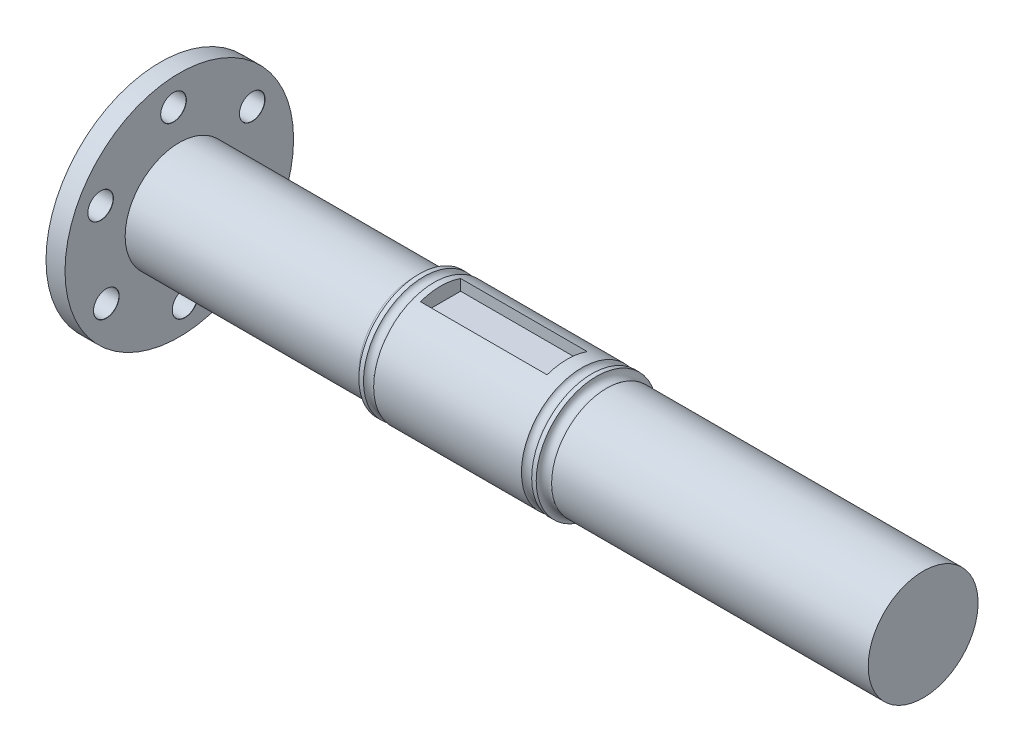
ISO-10303-21;
HEADER;
FILE_DESCRIPTION(('STEP AP214'),'2;1');
FILE_NAME('part.step','',(''),(''),'','','');
FILE_SCHEMA(('AUTOMOTIVE_DESIGN { 1 0 10303 214 1 1 1 1 }'));
ENDSEC;
DATA;
#1=APPLICATION_CONTEXT('core data for automotive mechanical design processes');
#2=APPLICATION_PROTOCOL_DEFINITION('international standard','automotive_design',2000,#1);
#3=PRODUCT_CONTEXT('',#1,'mechanical');
#4=PRODUCT('Part','Part','',(#3));
#5=PRODUCT_RELATED_PRODUCT_CATEGORY('part','',(#4));
#6=PRODUCT_DEFINITION_FORMATION('','',#4);
#7=PRODUCT_DEFINITION_CONTEXT('part definition',#1,'design');
#8=PRODUCT_DEFINITION('design','',#6,#7);
#9=PRODUCT_DEFINITION_SHAPE('','',#8);
#10=(LENGTH_UNIT() NAMED_UNIT(*) SI_UNIT(.MILLI.,.METRE.));
#11=(NAMED_UNIT(*) PLANE_ANGLE_UNIT() SI_UNIT($,.RADIAN.));
#12=(NAMED_UNIT(*) SI_UNIT($,.STERADIAN.) SOLID_ANGLE_UNIT());
#13=UNCERTAINTY_MEASURE_WITH_UNIT(LENGTH_MEASURE(1.E-05),#10,'distance_accuracy_value','');
#14=(GEOMETRIC_REPRESENTATION_CONTEXT(3) GLOBAL_UNCERTAINTY_ASSIGNED_CONTEXT((#13)) GLOBAL_UNIT_ASSIGNED_CONTEXT((#10,
#11,#12)) REPRESENTATION_CONTEXT('',''));
#15=CARTESIAN_POINT('',(0.,0.,0.));
#16=DIRECTION('',(0.,0.,1.));
#17=DIRECTION('',(1.,0.,0.));
#18=AXIS2_PLACEMENT_3D('',#15,#16,#17);
#19=CARTESIAN_POINT('',(15.223236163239,9.4610077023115,0.));
#20=DIRECTION('',(-1.,0.,0.));
#21=DIRECTION('',(0.,0.,1.));
#22=AXIS2_PLACEMENT_3D('',#19,#20,#21);
#23=CYLINDRICAL_SURFACE('',#22,9.54020579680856);
#24=CARTESIAN_POINT('',(86.2912501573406,9.4610077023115,0.));
#25=DIRECTION('',(-1.,0.,0.));
#26=DIRECTION('',(0.,0.,1.));
#27=AXIS2_PLACEMENT_3D('',#24,#25,#26);
#28=CIRCLE('',#27,9.54020579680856);
#29=CARTESIAN_POINT('',(86.2912501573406,9.4610077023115,9.54020579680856));
#30=VERTEX_POINT('',#29);
#31=EDGE_CURVE('E207',#30,#30,#28,.T.);
#32=ORIENTED_EDGE('',*,*,#31,.T.);
#33=EDGE_LOOP('',(#32));
#34=FACE_BOUND('',#33,.T.);
#35=CARTESIAN_POINT('',(62.9546037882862,9.4610077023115,0.));
#36=DIRECTION('',(-1.,0.,0.));
#37=DIRECTION('',(0.,0.,1.));
#38=AXIS2_PLACEMENT_3D('',#35,#36,#37);
#39=CIRCLE('',#38,9.54020579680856);
#40=CARTESIAN_POINT('',(62.9546037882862,9.4610077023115,9.54020579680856));
#41=VERTEX_POINT('',#40);
#42=EDGE_CURVE('E211',#41,#41,#39,.T.);
#43=ORIENTED_EDGE('',*,*,#42,.F.);
#44=EDGE_LOOP('',(#43));
#45=FACE_BOUND('',#44,.T.);
#46=DIRECTION('',(-1.,0.,0.));
#47=VECTOR('',#46,1.);
#48=CARTESIAN_POINT('',(15.223236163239,18.4573904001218,-3.175));
#49=LINE('',#48,#47);
#50=CARTESIAN_POINT('',(63.973236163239,18.4573904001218,-3.175));
#51=VERTEX_POINT('',#50);
#52=CARTESIAN_POINT('',(83.973236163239,18.4573904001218,-3.175));
#53=VERTEX_POINT('',#52);
#54=EDGE_CURVE('E267',#51,#53,#49,.F.);
#55=ORIENTED_EDGE('',*,*,#54,.T.);
#56=CARTESIAN_POINT('',(83.973236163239,9.4610077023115,0.));
#57=DIRECTION('',(-1.,0.,0.));
#58=DIRECTION('',(0.,0.,1.));
#59=AXIS2_PLACEMENT_3D('',#56,#57,#58);
#60=CIRCLE('',#59,9.54020579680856);
#61=CARTESIAN_POINT('',(83.973236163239,18.4573904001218,3.175));
#62=VERTEX_POINT('',#61);
#63=EDGE_CURVE('E11',#53,#62,#60,.F.);
#64=ORIENTED_EDGE('',*,*,#63,.T.);
#65=DIRECTION('',(-1.,0.,0.));
#66=VECTOR('',#65,1.);
#67=CARTESIAN_POINT('',(15.223236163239,18.4573904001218,3.175));
#68=LINE('',#67,#66);
#69=CARTESIAN_POINT('',(63.973236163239,18.4573904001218,3.175));
#70=VERTEX_POINT('',#69);
#71=EDGE_CURVE('E56',#62,#70,#68,.T.);
#72=ORIENTED_EDGE('',*,*,#71,.T.);
#73=CARTESIAN_POINT('',(63.973236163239,9.4610077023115,0.));
#74=DIRECTION('',(-1.,0.,0.));
#75=DIRECTION('',(0.,0.,1.));
#76=AXIS2_PLACEMENT_3D('',#73,#74,#75);
#77=CIRCLE('',#76,9.54020579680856);
#78=EDGE_CURVE('E94',#51,#70,#77,.F.);
#79=ORIENTED_EDGE('',*,*,#78,.F.);
#80=EDGE_LOOP('',(#55,#64,#72,#79));
#81=FACE_BOUND('',#80,.T.);
#82=ADVANCED_FACE('F47',(#34,#45,#81),#23,.T.);
#83=CARTESIAN_POINT('',(15.223236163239,0.,0.));
#84=DIRECTION('',(1.,0.,0.));
#85=DIRECTION('',(0.,0.,-1.));
#86=AXIS2_PLACEMENT_3D('',#83,#84,#85);
#87=PLANE('',#86);
#88=CARTESIAN_POINT('',(15.223236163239,9.4610077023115,0.));
#89=DIRECTION('',(1.,0.,0.));
#90=DIRECTION('',(0.,0.,-1.));
#91=AXIS2_PLACEMENT_3D('',#88,#89,#90);
#92=CIRCLE('',#91,2.);
#93=CARTESIAN_POINT('',(15.223236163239,9.4610077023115,-2.));
#94=VERTEX_POINT('',#93);
#95=EDGE_CURVE('E187',#94,#94,#92,.T.);
#96=ORIENTED_EDGE('',*,*,#95,.T.);
#97=EDGE_LOOP('',(#96));
#98=FACE_BOUND('',#97,.T.);
#99=CARTESIAN_POINT('',(15.223236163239,9.4610077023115,0.));
#100=DIRECTION('',(-1.,0.,0.));
#101=DIRECTION('',(0.,0.,1.));
#102=AXIS2_PLACEMENT_3D('',#99,#100,#101);
#103=CIRCLE('',#102,10.5);
#104=CARTESIAN_POINT('',(15.223236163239,9.4610077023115,10.5));
#105=VERTEX_POINT('',#104);
#106=EDGE_CURVE('E243',#105,#105,#103,.T.);
#107=ORIENTED_EDGE('',*,*,#106,.T.);
#108=EDGE_LOOP('',(#107));
#109=FACE_BOUND('',#108,.T.);
#110=ADVANCED_FACE('F49',(#98,#109),#87,.F.);
#111=CARTESIAN_POINT('',(15.223236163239,9.4610077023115,0.));
#112=DIRECTION('',(-1.,0.,0.));
#113=DIRECTION('',(0.,0.,1.));
#114=AXIS2_PLACEMENT_3D('',#111,#112,#113);
#115=CYLINDRICAL_SURFACE('',#114,10.5);
#116=CARTESIAN_POINT('',(19.723236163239,9.4610077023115,0.));
#117=DIRECTION('',(-1.,0.,0.));
#118=DIRECTION('',(0.,0.,1.));
#119=AXIS2_PLACEMENT_3D('',#116,#117,#118);
#120=CIRCLE('',#119,10.5);
#121=CARTESIAN_POINT('',(19.723236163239,9.4610077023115,10.5));
#122=VERTEX_POINT('',#121);
#123=EDGE_CURVE('E239',#122,#122,#120,.T.);
#124=ORIENTED_EDGE('',*,*,#123,.T.);
#125=EDGE_LOOP('',(#124));
#126=FACE_BOUND('',#125,.T.);
#127=ORIENTED_EDGE('',*,*,#106,.F.);
#128=EDGE_LOOP('',(#127));
#129=FACE_BOUND('',#128,.T.);
#130=ADVANCED_FACE('F291',(#126,#129),#115,.T.);
#131=CARTESIAN_POINT('',(19.723236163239,0.,0.));
#132=DIRECTION('',(-1.,0.,0.));
#133=DIRECTION('',(0.,0.,1.));
#134=AXIS2_PLACEMENT_3D('',#131,#132,#133);
#135=PLANE('',#134);
#136=CARTESIAN_POINT('',(19.723236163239,17.1610077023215,-11.518137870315));
#137=DIRECTION('',(-1.,0.,0.));
#138=DIRECTION('',(0.,0.,1.));
#139=AXIS2_PLACEMENT_3D('',#136,#137,#138);
#140=CIRCLE('',#139,2.);
#141=CARTESIAN_POINT('',(19.723236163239,17.1610077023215,-9.51813787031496));
#142=VERTEX_POINT('',#141);
#143=EDGE_CURVE('E133',#142,#142,#140,.T.);
#144=ORIENTED_EDGE('',*,*,#143,.F.);
#145=EDGE_LOOP('',(#144));
#146=FACE_BOUND('',#145,.T.);
#147=CARTESIAN_POINT('',(19.723236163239,3.33600770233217,-12.4274645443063));
#148=DIRECTION('',(-1.,0.,0.));
#149=DIRECTION('',(0.,0.,1.));
#150=AXIS2_PLACEMENT_3D('',#147,#148,#149);
#151=CIRCLE('',#150,2.);
#152=CARTESIAN_POINT('',(19.723236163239,3.33600770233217,-10.4274645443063));
#153=VERTEX_POINT('',#152);
#154=EDGE_CURVE('E142',#153,#153,#151,.T.);
#155=ORIENTED_EDGE('',*,*,#154,.F.);
#156=EDGE_LOOP('',(#155));
#157=FACE_BOUND('',#156,.T.);
#158=CARTESIAN_POINT('',(19.723236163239,23.2860077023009,0.90932667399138));
#159=DIRECTION('',(-1.,0.,0.));
#160=DIRECTION('',(0.,0.,1.));
#161=AXIS2_PLACEMENT_3D('',#158,#159,#160);
#162=CIRCLE('',#161,2.);
#163=CARTESIAN_POINT('',(19.723236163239,23.2860077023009,2.90932667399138));
#164=VERTEX_POINT('',#163);
#165=EDGE_CURVE('E151',#164,#164,#162,.T.);
#166=ORIENTED_EDGE('',*,*,#165,.F.);
#167=EDGE_LOOP('',(#166));
#168=FACE_BOUND('',#167,.T.);
#169=CARTESIAN_POINT('',(19.723236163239,-4.36399229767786,-0.909326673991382));
#170=DIRECTION('',(-1.,0.,0.));
#171=DIRECTION('',(0.,0.,1.));
#172=AXIS2_PLACEMENT_3D('',#169,#170,#171);
#173=CIRCLE('',#172,2.);
#174=CARTESIAN_POINT('',(19.723236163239,-4.36399229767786,1.09067332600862));
#175=VERTEX_POINT('',#174);
#176=EDGE_CURVE('E160',#175,#175,#173,.T.);
#177=ORIENTED_EDGE('',*,*,#176,.F.);
#178=EDGE_LOOP('',(#177));
#179=FACE_BOUND('',#178,.T.);
#180=CARTESIAN_POINT('',(19.723236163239,1.76100770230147,11.518137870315));
#181=DIRECTION('',(-1.,0.,0.));
#182=DIRECTION('',(0.,0.,1.));
#183=AXIS2_PLACEMENT_3D('',#180,#181,#182);
#184=CIRCLE('',#183,2.);
#185=CARTESIAN_POINT('',(19.723236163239,1.76100770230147,13.518137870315));
#186=VERTEX_POINT('',#185);
#187=EDGE_CURVE('E169',#186,#186,#184,.T.);
#188=ORIENTED_EDGE('',*,*,#187,.F.);
#189=EDGE_LOOP('',(#188));
#190=FACE_BOUND('',#189,.T.);
#191=CARTESIAN_POINT('',(19.723236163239,15.5860077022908,12.4274645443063));
#192=DIRECTION('',(-1.,0.,0.));
#193=DIRECTION('',(0.,0.,1.));
#194=AXIS2_PLACEMENT_3D('',#191,#192,#193);
#195=CIRCLE('',#194,2.);
#196=CARTESIAN_POINT('',(19.723236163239,15.5860077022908,14.4274645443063));
#197=VERTEX_POINT('',#196);
#198=EDGE_CURVE('E178',#197,#197,#195,.T.);
#199=ORIENTED_EDGE('',*,*,#198,.F.);
#200=EDGE_LOOP('',(#199));
#201=FACE_BOUND('',#200,.T.);
#202=CARTESIAN_POINT('',(19.723236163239,9.4610077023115,0.));
#203=DIRECTION('',(-1.,0.,0.));
#204=DIRECTION('',(0.,0.,1.));
#205=AXIS2_PLACEMENT_3D('',#202,#203,#204);
#206=CIRCLE('',#205,18.05);
#207=CARTESIAN_POINT('',(19.723236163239,9.4610077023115,18.05));
#208=VERTEX_POINT('',#207);
#209=EDGE_CURVE('E235',#208,#208,#206,.T.);
#210=ORIENTED_EDGE('',*,*,#209,.T.);
#211=EDGE_LOOP('',(#210));
#212=FACE_BOUND('',#211,.T.);
#213=ORIENTED_EDGE('',*,*,#123,.F.);
#214=EDGE_LOOP('',(#213));
#215=FACE_BOUND('',#214,.T.);
#216=ADVANCED_FACE('F321',(#146,#157,#168,#179,#190,#201,#212,#215),#135,.T.);
#217=CARTESIAN_POINT('',(15.223236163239,9.4610077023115,0.));
#218=DIRECTION('',(-1.,0.,0.));
#219=DIRECTION('',(0.,0.,1.));
#220=AXIS2_PLACEMENT_3D('',#217,#218,#219);
#221=CYLINDRICAL_SURFACE('',#220,18.05);
#222=CARTESIAN_POINT('',(22.723236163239,9.4610077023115,0.));
#223=DIRECTION('',(-1.,0.,0.));
#224=DIRECTION('',(0.,0.,1.));
#225=AXIS2_PLACEMENT_3D('',#222,#223,#224);
#226=CIRCLE('',#225,18.05);
#227=CARTESIAN_POINT('',(22.723236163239,9.4610077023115,18.05));
#228=VERTEX_POINT('',#227);
#229=EDGE_CURVE('E231',#228,#228,#226,.T.);
#230=ORIENTED_EDGE('',*,*,#229,.T.);
#231=EDGE_LOOP('',(#230));
#232=FACE_BOUND('',#231,.T.);
#233=ORIENTED_EDGE('',*,*,#209,.F.);
#234=EDGE_LOOP('',(#233));
#235=FACE_BOUND('',#234,.T.);
#236=ADVANCED_FACE('F317',(#232,#235),#221,.T.);
#237=CARTESIAN_POINT('',(22.723236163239,0.,0.));
#238=DIRECTION('',(1.,0.,0.));
#239=DIRECTION('',(0.,0.,-1.));
#240=AXIS2_PLACEMENT_3D('',#237,#238,#239);
#241=PLANE('',#240);
#242=CARTESIAN_POINT('',(22.723236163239,17.1610077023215,-11.518137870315));
#243=DIRECTION('',(1.,0.,0.));
#244=DIRECTION('',(0.,0.,-1.));
#245=AXIS2_PLACEMENT_3D('',#242,#243,#244);
#246=CIRCLE('',#245,2.025);
#247=CARTESIAN_POINT('',(22.723236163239,17.1610077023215,-13.543137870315));
#248=VERTEX_POINT('',#247);
#249=EDGE_CURVE('E106',#248,#248,#246,.T.);
#250=ORIENTED_EDGE('',*,*,#249,.F.);
#251=EDGE_LOOP('',(#250));
#252=FACE_BOUND('',#251,.T.);
#253=CARTESIAN_POINT('',(22.723236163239,3.33600770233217,-12.4274645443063));
#254=DIRECTION('',(1.,0.,0.));
#255=DIRECTION('',(0.,0.,-1.));
#256=AXIS2_PLACEMENT_3D('',#253,#254,#255);
#257=CIRCLE('',#256,2.025);
#258=CARTESIAN_POINT('',(22.723236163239,3.33600770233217,-14.4524645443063));
#259=VERTEX_POINT('',#258);
#260=EDGE_CURVE('E134',#259,#259,#257,.T.);
#261=ORIENTED_EDGE('',*,*,#260,.F.);
#262=EDGE_LOOP('',(#261));
#263=FACE_BOUND('',#262,.T.);
#264=CARTESIAN_POINT('',(22.723236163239,23.2860077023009,0.90932667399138));
#265=DIRECTION('',(1.,0.,0.));
#266=DIRECTION('',(0.,0.,-1.));
#267=AXIS2_PLACEMENT_3D('',#264,#265,#266);
#268=CIRCLE('',#267,2.025);
#269=CARTESIAN_POINT('',(22.723236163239,23.2860077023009,-1.11567332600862));
#270=VERTEX_POINT('',#269);
#271=EDGE_CURVE('E143',#270,#270,#268,.T.);
#272=ORIENTED_EDGE('',*,*,#271,.F.);
#273=EDGE_LOOP('',(#272));
#274=FACE_BOUND('',#273,.T.);
#275=CARTESIAN_POINT('',(22.723236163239,-4.36399229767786,-0.909326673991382));
#276=DIRECTION('',(1.,0.,0.));
#277=DIRECTION('',(0.,0.,-1.));
#278=AXIS2_PLACEMENT_3D('',#275,#276,#277);
#279=CIRCLE('',#278,2.025);
#280=CARTESIAN_POINT('',(22.723236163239,-4.36399229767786,-2.93432667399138));
#281=VERTEX_POINT('',#280);
#282=EDGE_CURVE('E152',#281,#281,#279,.T.);
#283=ORIENTED_EDGE('',*,*,#282,.F.);
#284=EDGE_LOOP('',(#283));
#285=FACE_BOUND('',#284,.T.);
#286=CARTESIAN_POINT('',(22.723236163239,1.76100770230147,11.518137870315));
#287=DIRECTION('',(1.,0.,0.));
#288=DIRECTION('',(0.,0.,-1.));
#289=AXIS2_PLACEMENT_3D('',#286,#287,#288);
#290=CIRCLE('',#289,2.025);
#291=CARTESIAN_POINT('',(22.723236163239,1.76100770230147,9.49313787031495));
#292=VERTEX_POINT('',#291);
#293=EDGE_CURVE('E161',#292,#292,#290,.T.);
#294=ORIENTED_EDGE('',*,*,#293,.F.);
#295=EDGE_LOOP('',(#294));
#296=FACE_BOUND('',#295,.T.);
#297=CARTESIAN_POINT('',(22.723236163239,15.5860077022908,12.4274645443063));
#298=DIRECTION('',(1.,0.,0.));
#299=DIRECTION('',(0.,0.,-1.));
#300=AXIS2_PLACEMENT_3D('',#297,#298,#299);
#301=CIRCLE('',#300,2.025);
#302=CARTESIAN_POINT('',(22.723236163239,15.5860077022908,10.4024645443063));
#303=VERTEX_POINT('',#302);
#304=EDGE_CURVE('E170',#303,#303,#301,.T.);
#305=ORIENTED_EDGE('',*,*,#304,.F.);
#306=EDGE_LOOP('',(#305));
#307=FACE_BOUND('',#306,.T.);
#308=CARTESIAN_POINT('',(22.723236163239,9.4610077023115,0.));
#309=DIRECTION('',(-1.,0.,0.));
#310=DIRECTION('',(0.,0.,1.));
#311=AXIS2_PLACEMENT_3D('',#308,#309,#310);
#312=CIRCLE('',#311,8.55);
#313=CARTESIAN_POINT('',(22.723236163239,9.4610077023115,8.55));
#314=VERTEX_POINT('',#313);
#315=EDGE_CURVE('E227',#314,#314,#312,.T.);
#316=ORIENTED_EDGE('',*,*,#315,.T.);
#317=EDGE_LOOP('',(#316));
#318=FACE_BOUND('',#317,.T.);
#319=ORIENTED_EDGE('',*,*,#229,.F.);
#320=EDGE_LOOP('',(#319));
#321=FACE_BOUND('',#320,.T.);
#322=ADVANCED_FACE('F313',(#252,#263,#274,#285,#296,#307,#318,#321),#241,.T.);
#323=CARTESIAN_POINT('',(15.223236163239,9.4610077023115,0.));
#324=DIRECTION('',(-1.,0.,0.));
#325=DIRECTION('',(0.,0.,1.));
#326=AXIS2_PLACEMENT_3D('',#323,#324,#325);
#327=CYLINDRICAL_SURFACE('',#326,8.55);
#328=CARTESIAN_POINT('',(59.653236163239,9.4610077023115,0.));
#329=DIRECTION('',(-1.,0.,0.));
#330=DIRECTION('',(0.,0.,1.));
#331=AXIS2_PLACEMENT_3D('',#328,#329,#330);
#332=CIRCLE('',#331,8.55);
#333=CARTESIAN_POINT('',(59.653236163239,9.4610077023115,8.55));
#334=VERTEX_POINT('',#333);
#335=EDGE_CURVE('E223',#334,#334,#332,.T.);
#336=ORIENTED_EDGE('',*,*,#335,.T.);
#337=EDGE_LOOP('',(#336));
#338=FACE_BOUND('',#337,.T.);
#339=ORIENTED_EDGE('',*,*,#315,.F.);
#340=EDGE_LOOP('',(#339));
#341=FACE_BOUND('',#340,.T.);
#342=ADVANCED_FACE('F309',(#338,#341),#327,.T.);
#343=CARTESIAN_POINT('',(59.6212935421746,9.4610077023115,0.));
#344=DIRECTION('',(-1.,0.,0.));
#345=DIRECTION('',(0.,0.,1.));
#346=AXIS2_PLACEMENT_3D('',#343,#344,#345);
#347=TOROIDAL_SURFACE('',#346,9.5494897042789,0.999999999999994);
#348=ORIENTED_EDGE('',*,*,#335,.F.);
#349=EDGE_LOOP('',(#348));
#350=FACE_BOUND('',#349,.T.);
#351=CARTESIAN_POINT('',(60.621250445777,9.4610077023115,0.));
#352=DIRECTION('',(-1.,0.,0.));
#353=DIRECTION('',(0.,0.,1.));
#354=AXIS2_PLACEMENT_3D('',#351,#352,#353);
#355=CIRCLE('',#354,9.54020579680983);
#356=CARTESIAN_POINT('',(60.621250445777,9.4610077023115,9.54020579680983));
#357=VERTEX_POINT('',#356);
#358=EDGE_CURVE('E219',#357,#357,#355,.T.);
#359=ORIENTED_EDGE('',*,*,#358,.T.);
#360=EDGE_LOOP('',(#359));
#361=FACE_BOUND('',#360,.T.);
#362=ADVANCED_FACE('F305',(#350,#361),#347,.F.);
#363=CARTESIAN_POINT('',(15.223236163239,9.4610077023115,0.));
#364=DIRECTION('',(-1.,0.,0.));
#365=DIRECTION('',(0.,0.,1.));
#366=AXIS2_PLACEMENT_3D('',#363,#364,#365);
#367=CYLINDRICAL_SURFACE('',#366,9.54020579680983);
#368=CARTESIAN_POINT('',(61.3447504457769,9.4610077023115,0.));
#369=DIRECTION('',(-1.,0.,0.));
#370=DIRECTION('',(0.,0.,1.));
#371=AXIS2_PLACEMENT_3D('',#368,#369,#370);
#372=CIRCLE('',#371,9.54020579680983);
#373=CARTESIAN_POINT('',(61.3447504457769,9.4610077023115,9.54020579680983));
#374=VERTEX_POINT('',#373);
#375=EDGE_CURVE('E215',#374,#374,#372,.T.);
#376=ORIENTED_EDGE('',*,*,#375,.T.);
#377=EDGE_LOOP('',(#376));
#378=FACE_BOUND('',#377,.T.);
#379=ORIENTED_EDGE('',*,*,#358,.F.);
#380=EDGE_LOOP('',(#379));
#381=FACE_BOUND('',#380,.T.);
#382=ADVANCED_FACE('F301',(#378,#381),#367,.T.);
#383=CARTESIAN_POINT('',(62.1496771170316,9.4610077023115,0.));
#384=DIRECTION('',(-1.,0.,0.));
#385=DIRECTION('',(0.,0.,1.));
#386=AXIS2_PLACEMENT_3D('',#383,#384,#385);
#387=TOROIDAL_SURFACE('',#386,9.92726729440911,0.893153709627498);
#388=ORIENTED_EDGE('',*,*,#42,.T.);
#389=EDGE_LOOP('',(#388));
#390=FACE_BOUND('',#389,.T.);
#391=ORIENTED_EDGE('',*,*,#375,.F.);
#392=EDGE_LOOP('',(#391));
#393=FACE_BOUND('',#392,.T.);
#394=ADVANCED_FACE('F298',(#390,#393),#387,.F.);
#395=CARTESIAN_POINT('',(87.0974731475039,9.4610077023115,0.));
#396=DIRECTION('',(-1.,0.,0.));
#397=DIRECTION('',(0.,0.,1.));
#398=AXIS2_PLACEMENT_3D('',#395,#396,#397);
#399=TOROIDAL_SURFACE('',#398,9.92320319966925,0.892570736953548);
#400=CARTESIAN_POINT('',(87.9012501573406,9.4610077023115,0.));
#401=DIRECTION('',(-1.,0.,0.));
#402=DIRECTION('',(0.,0.,1.));
#403=AXIS2_PLACEMENT_3D('',#400,#401,#402);
#404=CIRCLE('',#403,9.53509878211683);
#405=CARTESIAN_POINT('',(87.9012501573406,9.4610077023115,9.53509878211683));
#406=VERTEX_POINT('',#405);
#407=EDGE_CURVE('E203',#406,#406,#404,.T.);
#408=ORIENTED_EDGE('',*,*,#407,.T.);
#409=EDGE_LOOP('',(#408));
#410=FACE_BOUND('',#409,.T.);
#411=ORIENTED_EDGE('',*,*,#31,.F.);
#412=EDGE_LOOP('',(#411));
#413=FACE_BOUND('',#412,.T.);
#414=ADVANCED_FACE('F296',(#410,#413),#399,.F.);
#415=CARTESIAN_POINT('',(87.9012501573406,9.4610077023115,0.));
#416=DIRECTION('',(1.,0.,0.));
#417=DIRECTION('',(0.,0.,-1.));
#418=AXIS2_PLACEMENT_3D('',#415,#416,#417);
#419=CONICAL_SURFACE('',#418,9.53509878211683,0.00151111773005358);
#420=CARTESIAN_POINT('',(88.6212501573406,9.4610077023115,0.));
#421=DIRECTION('',(-1.,0.,0.));
#422=DIRECTION('',(0.,0.,1.));
#423=AXIS2_PLACEMENT_3D('',#420,#421,#422);
#424=CIRCLE('',#423,9.53618678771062);
#425=CARTESIAN_POINT('',(88.6212501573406,9.4610077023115,9.53618678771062));
#426=VERTEX_POINT('',#425);
#427=EDGE_CURVE('E199',#426,#426,#424,.T.);
#428=ORIENTED_EDGE('',*,*,#427,.T.);
#429=EDGE_LOOP('',(#428));
#430=FACE_BOUND('',#429,.T.);
#431=ORIENTED_EDGE('',*,*,#407,.F.);
#432=EDGE_LOOP('',(#431));
#433=FACE_BOUND('',#432,.T.);
#434=ADVANCED_FACE('F369',(#430,#433),#419,.T.);
#435=CARTESIAN_POINT('',(89.6204667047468,9.4610077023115,0.));
#436=DIRECTION('',(-1.,0.,0.));
#437=DIRECTION('',(0.,0.,1.));
#438=AXIS2_PLACEMENT_3D('',#435,#436,#437);
#439=TOROIDAL_SURFACE('',#438,9.4966103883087,0.999999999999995);
#440=CARTESIAN_POINT('',(90.1914298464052,9.4610077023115,0.));
#441=DIRECTION('',(-1.,0.,0.));
#442=DIRECTION('',(0.,0.,1.));
#443=AXIS2_PLACEMENT_3D('',#440,#441,#442);
#444=CIRCLE('',#443,8.67563469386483);
#445=CARTESIAN_POINT('',(90.1914298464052,9.4610077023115,8.67563469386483));
#446=VERTEX_POINT('',#445);
#447=EDGE_CURVE('E195',#446,#446,#444,.T.);
#448=ORIENTED_EDGE('',*,*,#447,.T.);
#449=EDGE_LOOP('',(#448));
#450=FACE_BOUND('',#449,.T.);
#451=ORIENTED_EDGE('',*,*,#427,.F.);
#452=EDGE_LOOP('',(#451));
#453=FACE_BOUND('',#452,.T.);
#454=ADVANCED_FACE('F377',(#450,#453),#439,.F.);
#455=CARTESIAN_POINT('',(15.223236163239,9.4610077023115,0.));
#456=DIRECTION('',(-1.,0.,0.));
#457=DIRECTION('',(0.,0.,1.));
#458=AXIS2_PLACEMENT_3D('',#455,#456,#457);
#459=CYLINDRICAL_SURFACE('',#458,8.67563469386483);
#460=CARTESIAN_POINT('',(140.191429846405,9.4610077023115,0.));
#461=DIRECTION('',(-1.,0.,0.));
#462=DIRECTION('',(0.,0.,1.));
#463=AXIS2_PLACEMENT_3D('',#460,#461,#462);
#464=CIRCLE('',#463,8.67563469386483);
#465=CARTESIAN_POINT('',(140.191429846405,9.4610077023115,8.67563469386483));
#466=VERTEX_POINT('',#465);
#467=EDGE_CURVE('E191',#466,#466,#464,.T.);
#468=ORIENTED_EDGE('',*,*,#467,.T.);
#469=EDGE_LOOP('',(#468));
#470=FACE_BOUND('',#469,.T.);
#471=ORIENTED_EDGE('',*,*,#447,.F.);
#472=EDGE_LOOP('',(#471));
#473=FACE_BOUND('',#472,.T.);
#474=ADVANCED_FACE('F385',(#470,#473),#459,.T.);
#475=CARTESIAN_POINT('',(140.191429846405,0.,0.));
#476=DIRECTION('',(1.,0.,0.));
#477=DIRECTION('',(0.,0.,-1.));
#478=AXIS2_PLACEMENT_3D('',#475,#476,#477);
#479=PLANE('',#478);
#480=ORIENTED_EDGE('',*,*,#467,.F.);
#481=EDGE_LOOP('',(#480));
#482=FACE_BOUND('',#481,.T.);
#483=ADVANCED_FACE('F394',(#482),#479,.T.);
#484=CARTESIAN_POINT('',(22.723236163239,11.4860077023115,0.));
#485=DIRECTION('',(1.,0.,0.));
#486=DIRECTION('',(0.,0.,-1.));
#487=AXIS2_PLACEMENT_3D('',#484,#485,#486);
#488=PLANE('',#487);
#489=CARTESIAN_POINT('',(22.723236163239,9.4610077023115,0.));
#490=DIRECTION('',(1.,0.,0.));
#491=DIRECTION('',(0.,0.,-1.));
#492=AXIS2_PLACEMENT_3D('',#489,#490,#491);
#493=CIRCLE('',#492,2.025);
#494=CARTESIAN_POINT('',(22.723236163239,9.4610077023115,-2.025));
#495=VERTEX_POINT('',#494);
#496=EDGE_CURVE('E179',#495,#495,#493,.T.);
#497=ORIENTED_EDGE('',*,*,#496,.F.);
#498=EDGE_LOOP('',(#497));
#499=FACE_BOUND('',#498,.T.);
#500=ADVANCED_FACE('F402',(#499),#488,.F.);
#501=CARTESIAN_POINT('',(22.723236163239,9.4610077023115,0.));
#502=DIRECTION('',(1.,0.,0.));
#503=DIRECTION('',(0.,0.,-1.));
#504=AXIS2_PLACEMENT_3D('',#501,#502,#503);
#505=CYLINDRICAL_SURFACE('',#504,2.);
#506=ORIENTED_EDGE('',*,*,#95,.F.);
#507=EDGE_LOOP('',(#506));
#508=FACE_BOUND('',#507,.T.);
#509=CARTESIAN_POINT('',(22.698236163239,9.4610077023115,0.));
#510=DIRECTION('',(1.,0.,0.));
#511=DIRECTION('',(0.,0.,-1.));
#512=AXIS2_PLACEMENT_3D('',#509,#510,#511);
#513=CIRCLE('',#512,2.);
#514=CARTESIAN_POINT('',(22.698236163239,9.4610077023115,-2.));
#515=VERTEX_POINT('',#514);
#516=EDGE_CURVE('E183',#515,#515,#513,.T.);
#517=ORIENTED_EDGE('',*,*,#516,.T.);
#518=EDGE_LOOP('',(#517));
#519=FACE_BOUND('',#518,.T.);
#520=ADVANCED_FACE('F424',(#508,#519),#505,.F.);
#521=CARTESIAN_POINT('',(22.723236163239,9.4610077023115,0.));
#522=DIRECTION('',(1.,0.,0.));
#523=DIRECTION('',(0.,0.,-1.));
#524=AXIS2_PLACEMENT_3D('',#521,#522,#523);
#525=CONICAL_SURFACE('',#524,2.025,0.785398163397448);
#526=ORIENTED_EDGE('',*,*,#516,.F.);
#527=EDGE_LOOP('',(#526));
#528=FACE_BOUND('',#527,.T.);
#529=ORIENTED_EDGE('',*,*,#496,.T.);
#530=EDGE_LOOP('',(#529));
#531=FACE_BOUND('',#530,.T.);
#532=ADVANCED_FACE('F433',(#528,#531),#525,.F.);
#533=CARTESIAN_POINT('',(22.723236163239,15.5860077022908,12.4274645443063));
#534=DIRECTION('',(1.,0.,0.));
#535=DIRECTION('',(0.,0.,-1.));
#536=AXIS2_PLACEMENT_3D('',#533,#534,#535);
#537=CYLINDRICAL_SURFACE('',#536,2.);
#538=ORIENTED_EDGE('',*,*,#198,.T.);
#539=EDGE_LOOP('',(#538));
#540=FACE_BOUND('',#539,.T.);
#541=CARTESIAN_POINT('',(22.698236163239,15.5860077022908,12.4274645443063));
#542=DIRECTION('',(1.,0.,0.));
#543=DIRECTION('',(0.,0.,-1.));
#544=AXIS2_PLACEMENT_3D('',#541,#542,#543);
#545=CIRCLE('',#544,2.);
#546=CARTESIAN_POINT('',(22.698236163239,15.5860077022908,10.4274645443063));
#547=VERTEX_POINT('',#546);
#548=EDGE_CURVE('E174',#547,#547,#545,.T.);
#549=ORIENTED_EDGE('',*,*,#548,.T.);
#550=EDGE_LOOP('',(#549));
#551=FACE_BOUND('',#550,.T.);
#552=ADVANCED_FACE('F442',(#540,#551),#537,.F.);
#553=CARTESIAN_POINT('',(22.723236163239,15.5860077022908,12.4274645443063));
#554=DIRECTION('',(1.,0.,0.));
#555=DIRECTION('',(0.,0.,-1.));
#556=AXIS2_PLACEMENT_3D('',#553,#554,#555);
#557=CONICAL_SURFACE('',#556,2.025,0.785398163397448);
#558=ORIENTED_EDGE('',*,*,#548,.F.);
#559=EDGE_LOOP('',(#558));
#560=FACE_BOUND('',#559,.T.);
#561=ORIENTED_EDGE('',*,*,#304,.T.);
#562=EDGE_LOOP('',(#561));
#563=FACE_BOUND('',#562,.T.);
#564=ADVANCED_FACE('F451',(#560,#563),#557,.F.);
#565=CARTESIAN_POINT('',(22.723236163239,1.76100770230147,11.518137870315));
#566=DIRECTION('',(1.,0.,0.));
#567=DIRECTION('',(0.,0.,-1.));
#568=AXIS2_PLACEMENT_3D('',#565,#566,#567);
#569=CYLINDRICAL_SURFACE('',#568,2.);
#570=ORIENTED_EDGE('',*,*,#187,.T.);
#571=EDGE_LOOP('',(#570));
#572=FACE_BOUND('',#571,.T.);
#573=CARTESIAN_POINT('',(22.698236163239,1.76100770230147,11.518137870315));
#574=DIRECTION('',(1.,0.,0.));
#575=DIRECTION('',(0.,0.,-1.));
#576=AXIS2_PLACEMENT_3D('',#573,#574,#575);
#577=CIRCLE('',#576,2.);
#578=CARTESIAN_POINT('',(22.698236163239,1.76100770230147,9.51813787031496));
#579=VERTEX_POINT('',#578);
#580=EDGE_CURVE('E165',#579,#579,#577,.T.);
#581=ORIENTED_EDGE('',*,*,#580,.T.);
#582=EDGE_LOOP('',(#581));
#583=FACE_BOUND('',#582,.T.);
#584=ADVANCED_FACE('F460',(#572,#583),#569,.F.);
#585=CARTESIAN_POINT('',(22.723236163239,1.76100770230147,11.518137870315));
#586=DIRECTION('',(1.,0.,0.));
#587=DIRECTION('',(0.,0.,-1.));
#588=AXIS2_PLACEMENT_3D('',#585,#586,#587);
#589=CONICAL_SURFACE('',#588,2.025,0.785398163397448);
#590=ORIENTED_EDGE('',*,*,#580,.F.);
#591=EDGE_LOOP('',(#590));
#592=FACE_BOUND('',#591,.T.);
#593=ORIENTED_EDGE('',*,*,#293,.T.);
#594=EDGE_LOOP('',(#593));
#595=FACE_BOUND('',#594,.T.);
#596=ADVANCED_FACE('F469',(#592,#595),#589,.F.);
#597=CARTESIAN_POINT('',(22.723236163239,-4.36399229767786,-0.909326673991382));
#598=DIRECTION('',(1.,0.,0.));
#599=DIRECTION('',(0.,0.,-1.));
#600=AXIS2_PLACEMENT_3D('',#597,#598,#599);
#601=CYLINDRICAL_SURFACE('',#600,2.);
#602=ORIENTED_EDGE('',*,*,#176,.T.);
#603=EDGE_LOOP('',(#602));
#604=FACE_BOUND('',#603,.T.);
#605=CARTESIAN_POINT('',(22.698236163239,-4.36399229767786,-0.909326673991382));
#606=DIRECTION('',(1.,0.,0.));
#607=DIRECTION('',(0.,0.,-1.));
#608=AXIS2_PLACEMENT_3D('',#605,#606,#607);
#609=CIRCLE('',#608,2.);
#610=CARTESIAN_POINT('',(22.698236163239,-4.36399229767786,-2.90932667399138));
#611=VERTEX_POINT('',#610);
#612=EDGE_CURVE('E156',#611,#611,#609,.T.);
#613=ORIENTED_EDGE('',*,*,#612,.T.);
#614=EDGE_LOOP('',(#613));
#615=FACE_BOUND('',#614,.T.);
#616=ADVANCED_FACE('F478',(#604,#615),#601,.F.);
#617=CARTESIAN_POINT('',(22.723236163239,-4.36399229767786,-0.909326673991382));
#618=DIRECTION('',(1.,0.,0.));
#619=DIRECTION('',(0.,0.,-1.));
#620=AXIS2_PLACEMENT_3D('',#617,#618,#619);
#621=CONICAL_SURFACE('',#620,2.025,0.785398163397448);
#622=ORIENTED_EDGE('',*,*,#612,.F.);
#623=EDGE_LOOP('',(#622));
#624=FACE_BOUND('',#623,.T.);
#625=ORIENTED_EDGE('',*,*,#282,.T.);
#626=EDGE_LOOP('',(#625));
#627=FACE_BOUND('',#626,.T.);
#628=ADVANCED_FACE('F487',(#624,#627),#621,.F.);
#629=CARTESIAN_POINT('',(22.723236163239,23.2860077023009,0.90932667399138));
#630=DIRECTION('',(1.,0.,0.));
#631=DIRECTION('',(0.,0.,-1.));
#632=AXIS2_PLACEMENT_3D('',#629,#630,#631);
#633=CYLINDRICAL_SURFACE('',#632,2.);
#634=ORIENTED_EDGE('',*,*,#165,.T.);
#635=EDGE_LOOP('',(#634));
#636=FACE_BOUND('',#635,.T.);
#637=CARTESIAN_POINT('',(22.698236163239,23.2860077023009,0.90932667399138));
#638=DIRECTION('',(1.,0.,0.));
#639=DIRECTION('',(0.,0.,-1.));
#640=AXIS2_PLACEMENT_3D('',#637,#638,#639);
#641=CIRCLE('',#640,2.);
#642=CARTESIAN_POINT('',(22.698236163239,23.2860077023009,-1.09067332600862));
#643=VERTEX_POINT('',#642);
#644=EDGE_CURVE('E147',#643,#643,#641,.T.);
#645=ORIENTED_EDGE('',*,*,#644,.T.);
#646=EDGE_LOOP('',(#645));
#647=FACE_BOUND('',#646,.T.);
#648=ADVANCED_FACE('F496',(#636,#647),#633,.F.);
#649=CARTESIAN_POINT('',(22.723236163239,23.2860077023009,0.90932667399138));
#650=DIRECTION('',(1.,0.,0.));
#651=DIRECTION('',(0.,0.,-1.));
#652=AXIS2_PLACEMENT_3D('',#649,#650,#651);
#653=CONICAL_SURFACE('',#652,2.025,0.785398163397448);
#654=ORIENTED_EDGE('',*,*,#644,.F.);
#655=EDGE_LOOP('',(#654));
#656=FACE_BOUND('',#655,.T.);
#657=ORIENTED_EDGE('',*,*,#271,.T.);
#658=EDGE_LOOP('',(#657));
#659=FACE_BOUND('',#658,.T.);
#660=ADVANCED_FACE('F505',(#656,#659),#653,.F.);
#661=CARTESIAN_POINT('',(22.723236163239,3.33600770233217,-12.4274645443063));
#662=DIRECTION('',(1.,0.,0.));
#663=DIRECTION('',(0.,0.,-1.));
#664=AXIS2_PLACEMENT_3D('',#661,#662,#663);
#665=CYLINDRICAL_SURFACE('',#664,2.);
#666=ORIENTED_EDGE('',*,*,#154,.T.);
#667=EDGE_LOOP('',(#666));
#668=FACE_BOUND('',#667,.T.);
#669=CARTESIAN_POINT('',(22.698236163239,3.33600770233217,-12.4274645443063));
#670=DIRECTION('',(1.,0.,0.));
#671=DIRECTION('',(0.,0.,-1.));
#672=AXIS2_PLACEMENT_3D('',#669,#670,#671);
#673=CIRCLE('',#672,2.);
#674=CARTESIAN_POINT('',(22.698236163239,3.33600770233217,-14.4274645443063));
#675=VERTEX_POINT('',#674);
#676=EDGE_CURVE('E138',#675,#675,#673,.T.);
#677=ORIENTED_EDGE('',*,*,#676,.T.);
#678=EDGE_LOOP('',(#677));
#679=FACE_BOUND('',#678,.T.);
#680=ADVANCED_FACE('F514',(#668,#679),#665,.F.);
#681=CARTESIAN_POINT('',(22.723236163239,3.33600770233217,-12.4274645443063));
#682=DIRECTION('',(1.,0.,0.));
#683=DIRECTION('',(0.,0.,-1.));
#684=AXIS2_PLACEMENT_3D('',#681,#682,#683);
#685=CONICAL_SURFACE('',#684,2.025,0.785398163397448);
#686=ORIENTED_EDGE('',*,*,#676,.F.);
#687=EDGE_LOOP('',(#686));
#688=FACE_BOUND('',#687,.T.);
#689=ORIENTED_EDGE('',*,*,#260,.T.);
#690=EDGE_LOOP('',(#689));
#691=FACE_BOUND('',#690,.T.);
#692=ADVANCED_FACE('F523',(#688,#691),#685,.F.);
#693=CARTESIAN_POINT('',(22.723236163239,17.1610077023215,-11.518137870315));
#694=DIRECTION('',(1.,0.,0.));
#695=DIRECTION('',(0.,0.,-1.));
#696=AXIS2_PLACEMENT_3D('',#693,#694,#695);
#697=CYLINDRICAL_SURFACE('',#696,2.);
#698=ORIENTED_EDGE('',*,*,#143,.T.);
#699=EDGE_LOOP('',(#698));
#700=FACE_BOUND('',#699,.T.);
#701=CARTESIAN_POINT('',(22.698236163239,17.1610077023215,-11.518137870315));
#702=DIRECTION('',(1.,0.,0.));
#703=DIRECTION('',(0.,0.,-1.));
#704=AXIS2_PLACEMENT_3D('',#701,#702,#703);
#705=CIRCLE('',#704,2.);
#706=CARTESIAN_POINT('',(22.698236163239,17.1610077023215,-13.518137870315));
#707=VERTEX_POINT('',#706);
#708=EDGE_CURVE('E129',#707,#707,#705,.T.);
#709=ORIENTED_EDGE('',*,*,#708,.T.);
#710=EDGE_LOOP('',(#709));
#711=FACE_BOUND('',#710,.T.);
#712=ADVANCED_FACE('F532',(#700,#711),#697,.F.);
#713=CARTESIAN_POINT('',(22.723236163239,17.1610077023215,-11.518137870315));
#714=DIRECTION('',(1.,0.,0.));
#715=DIRECTION('',(0.,0.,-1.));
#716=AXIS2_PLACEMENT_3D('',#713,#714,#715);
#717=CONICAL_SURFACE('',#716,2.025,0.785398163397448);
#718=ORIENTED_EDGE('',*,*,#708,.F.);
#719=EDGE_LOOP('',(#718));
#720=FACE_BOUND('',#719,.T.);
#721=ORIENTED_EDGE('',*,*,#249,.T.);
#722=EDGE_LOOP('',(#721));
#723=FACE_BOUND('',#722,.T.);
#724=ADVANCED_FACE('F540',(#720,#723),#717,.F.);
#725=CARTESIAN_POINT('',(83.973236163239,16.7150477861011,3.175));
#726=DIRECTION('',(0.,0.,-1.));
#727=DIRECTION('',(0.,1.,0.));
#728=AXIS2_PLACEMENT_3D('',#725,#726,#727);
#729=PLANE('',#728);
#730=DIRECTION('',(0.,-1.,0.));
#731=VECTOR('',#730,1.);
#732=CARTESIAN_POINT('',(83.973236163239,16.7150477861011,3.175));
#733=LINE('',#732,#731);
#734=CARTESIAN_POINT('',(83.973236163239,16.7150477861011,3.175));
#735=VERTEX_POINT('',#734);
#736=EDGE_CURVE('E102',#62,#735,#733,.T.);
#737=ORIENTED_EDGE('',*,*,#736,.T.);
#738=DIRECTION('',(-1.,0.,0.));
#739=VECTOR('',#738,1.);
#740=CARTESIAN_POINT('',(83.973236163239,16.7150477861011,3.175));
#741=LINE('',#740,#739);
#742=CARTESIAN_POINT('',(63.973236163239,16.7150477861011,3.175));
#743=VERTEX_POINT('',#742);
#744=EDGE_CURVE('E100',#735,#743,#741,.T.);
#745=ORIENTED_EDGE('',*,*,#744,.T.);
#746=DIRECTION('',(0.,-1.,0.));
#747=VECTOR('',#746,1.);
#748=CARTESIAN_POINT('',(63.973236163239,16.7150477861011,3.175));
#749=LINE('',#748,#747);
#750=EDGE_CURVE('E88',#70,#743,#749,.T.);
#751=ORIENTED_EDGE('',*,*,#750,.F.);
#752=ORIENTED_EDGE('',*,*,#71,.F.);
#753=EDGE_LOOP('',(#737,#745,#751,#752));
#754=FACE_BOUND('',#753,.T.);
#755=ADVANCED_FACE('F101',(#754),#729,.T.);
#756=CARTESIAN_POINT('',(83.973236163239,16.7150477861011,3.175));
#757=DIRECTION('',(0.,1.,0.));
#758=DIRECTION('',(0.,0.,1.));
#759=AXIS2_PLACEMENT_3D('',#756,#757,#758);
#760=PLANE('',#759);
#761=ORIENTED_EDGE('',*,*,#744,.F.);
#762=DIRECTION('',(0.,0.,-1.));
#763=VECTOR('',#762,1.);
#764=CARTESIAN_POINT('',(83.973236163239,16.7150477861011,3.175));
#765=LINE('',#764,#763);
#766=CARTESIAN_POINT('',(83.973236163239,16.7150477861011,-3.175));
#767=VERTEX_POINT('',#766);
#768=EDGE_CURVE('E118',#735,#767,#765,.T.);
#769=ORIENTED_EDGE('',*,*,#768,.T.);
#770=DIRECTION('',(-1.,0.,0.));
#771=VECTOR('',#770,1.);
#772=CARTESIAN_POINT('',(83.973236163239,16.7150477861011,-3.175));
#773=LINE('',#772,#771);
#774=CARTESIAN_POINT('',(63.973236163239,16.7150477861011,-3.175));
#775=VERTEX_POINT('',#774);
#776=EDGE_CURVE('E107',#767,#775,#773,.T.);
#777=ORIENTED_EDGE('',*,*,#776,.T.);
#778=DIRECTION('',(0.,0.,-1.));
#779=VECTOR('',#778,1.);
#780=CARTESIAN_POINT('',(63.973236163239,16.7150477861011,3.175));
#781=LINE('',#780,#779);
#782=EDGE_CURVE('E92',#743,#775,#781,.T.);
#783=ORIENTED_EDGE('',*,*,#782,.F.);
#784=EDGE_LOOP('',(#761,#769,#777,#783));
#785=FACE_BOUND('',#784,.T.);
#786=ADVANCED_FACE('F109',(#785),#760,.T.);
#787=CARTESIAN_POINT('',(83.973236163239,16.7150477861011,-3.175));
#788=DIRECTION('',(0.,0.,1.));
#789=DIRECTION('',(0.,-1.,0.));
#790=AXIS2_PLACEMENT_3D('',#787,#788,#789);
#791=PLANE('',#790);
#792=DIRECTION('',(0.,1.,0.));
#793=VECTOR('',#792,1.);
#794=CARTESIAN_POINT('',(63.973236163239,16.7150477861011,-3.175));
#795=LINE('',#794,#793);
#796=EDGE_CURVE('E63',#775,#51,#795,.T.);
#797=ORIENTED_EDGE('',*,*,#796,.F.);
#798=ORIENTED_EDGE('',*,*,#776,.F.);
#799=DIRECTION('',(0.,1.,0.));
#800=VECTOR('',#799,1.);
#801=CARTESIAN_POINT('',(83.973236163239,16.7150477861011,-3.175));
#802=LINE('',#801,#800);
#803=EDGE_CURVE('E121',#767,#53,#802,.T.);
#804=ORIENTED_EDGE('',*,*,#803,.T.);
#805=ORIENTED_EDGE('',*,*,#54,.F.);
#806=EDGE_LOOP('',(#797,#798,#804,#805));
#807=FACE_BOUND('',#806,.T.);
#808=ADVANCED_FACE('F274',(#807),#791,.T.);
#809=CARTESIAN_POINT('',(83.973236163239,0.,0.));
#810=DIRECTION('',(-1.,0.,0.));
#811=DIRECTION('',(0.,0.,1.));
#812=AXIS2_PLACEMENT_3D('',#809,#810,#811);
#813=PLANE('',#812);
#814=ORIENTED_EDGE('',*,*,#803,.F.);
#815=ORIENTED_EDGE('',*,*,#768,.F.);
#816=ORIENTED_EDGE('',*,*,#736,.F.);
#817=ORIENTED_EDGE('',*,*,#63,.F.);
#818=EDGE_LOOP('',(#814,#815,#816,#817));
#819=FACE_BOUND('',#818,.T.);
#820=ADVANCED_FACE('F272',(#819),#813,.T.);
#821=CARTESIAN_POINT('',(63.973236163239,0.,0.));
#822=DIRECTION('',(-1.,0.,0.));
#823=DIRECTION('',(0.,0.,1.));
#824=AXIS2_PLACEMENT_3D('',#821,#822,#823);
#825=PLANE('',#824);
#826=ORIENTED_EDGE('',*,*,#78,.T.);
#827=ORIENTED_EDGE('',*,*,#750,.T.);
#828=ORIENTED_EDGE('',*,*,#782,.T.);
#829=ORIENTED_EDGE('',*,*,#796,.T.);
#830=EDGE_LOOP('',(#826,#827,#828,#829));
#831=FACE_BOUND('',#830,.T.);
#832=ADVANCED_FACE('F90',(#831),#825,.F.);
#833=CLOSED_SHELL('',(#82,#110,#130,#216,#236,#322,#342,#362,#382,#394,#414,#434,#454,#474,#483,
#500,#520,#532,#552,#564,#584,#596,#616,#628,#648,#660,#680,#692,#712,#724,#755,#786,#808,#820,#832));
#834=MANIFOLD_SOLID_BREP('B2',#833);
#835=ADVANCED_BREP_SHAPE_REPRESENTATION('',(#18,#834),#14);
#836=SHAPE_DEFINITION_REPRESENTATION(#9,#835);
ENDSEC;
END-ISO-10303-21;
